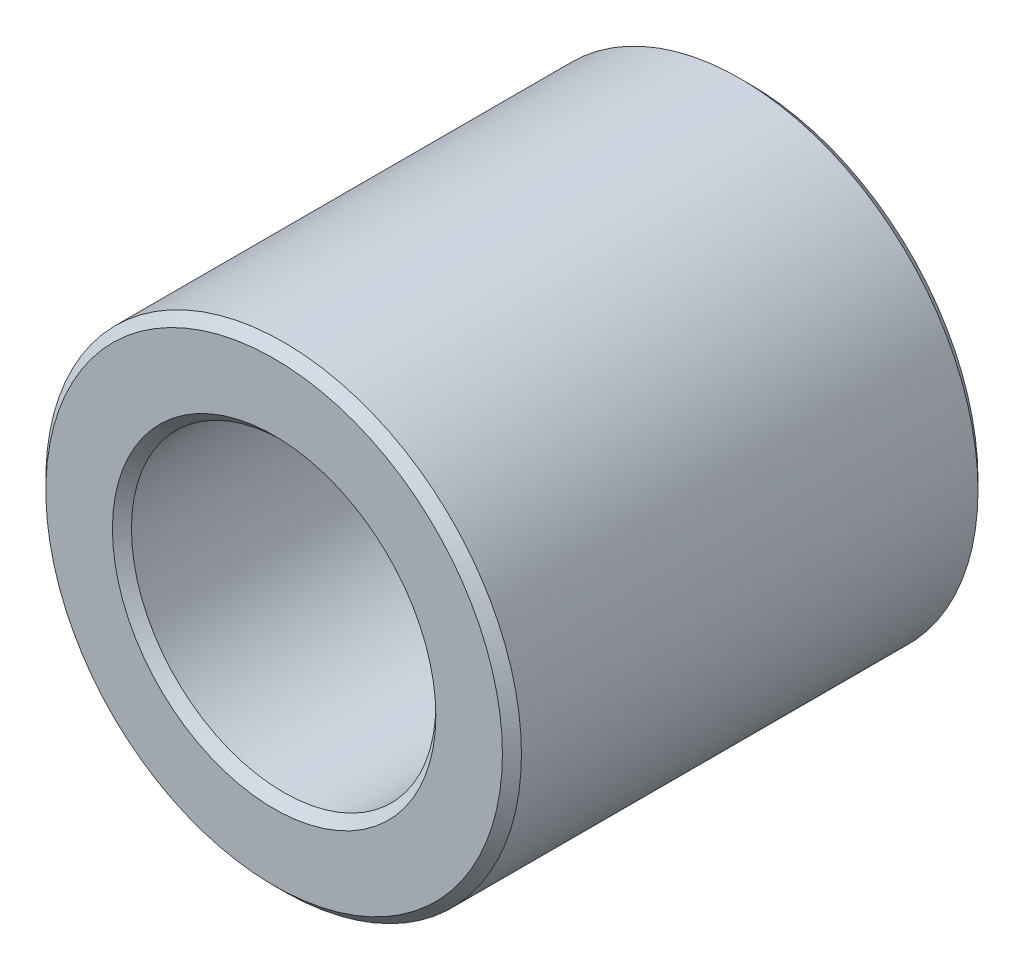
from build123d import *

# Parameters (mm, degrees)
SKETCH1_R           = 5
SKETCH1_R_2         = 3.2
BOSS_EXTRUDE2_DEPTH = 5
CHAMFER3_SIZE       = 0.2


with BuildPart() as part:
    # Sketch1 → Boss-Extrude2 (new, symmetric)
    with BuildSketch(Plane.XY):
        Circle(SKETCH1_R)
        Circle(SKETCH1_R_2, mode=Mode.SUBTRACT)
    extrude(amount=BOSS_EXTRUDE2_DEPTH, both=True)

    # Chamfer3
    chamfer3_edges = [part.edges().sort_by_distance(p)[0] for p in [
        (-5, 0, -5),
        (-5, 0, 5),
        (-3.2, 0, -5),
        (-3.2, 0, 5),
    ]]
    chamfer(chamfer3_edges, length=CHAMFER3_SIZE)


solid = part.part
